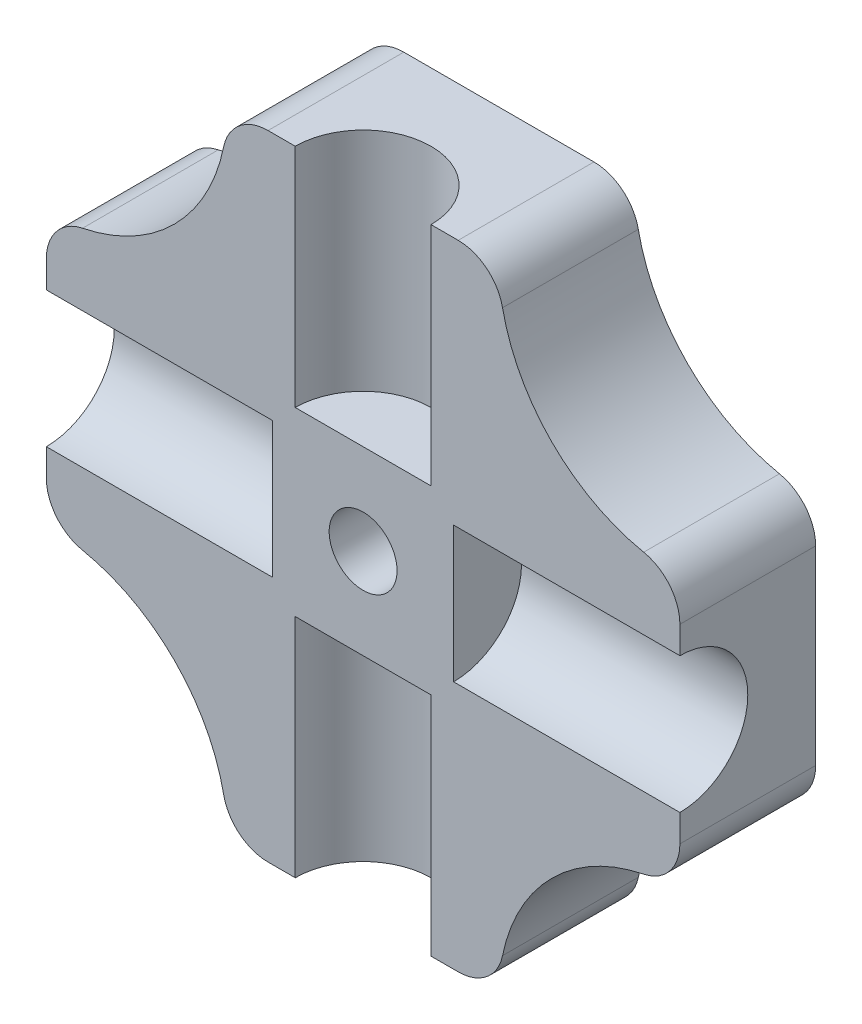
ISO-10303-21;
HEADER;
FILE_DESCRIPTION(('STEP AP214'),'2;1');
FILE_NAME('part.step','',(''),(''),'','','');
FILE_SCHEMA(('AUTOMOTIVE_DESIGN { 1 0 10303 214 1 1 1 1 }'));
ENDSEC;
DATA;
#1=APPLICATION_CONTEXT('core data for automotive mechanical design processes');
#2=APPLICATION_PROTOCOL_DEFINITION('international standard','automotive_design',2000,#1);
#3=PRODUCT_CONTEXT('',#1,'mechanical');
#4=PRODUCT('Part','Part','',(#3));
#5=PRODUCT_RELATED_PRODUCT_CATEGORY('part','',(#4));
#6=PRODUCT_DEFINITION_FORMATION('','',#4);
#7=PRODUCT_DEFINITION_CONTEXT('part definition',#1,'design');
#8=PRODUCT_DEFINITION('design','',#6,#7);
#9=PRODUCT_DEFINITION_SHAPE('','',#8);
#10=(LENGTH_UNIT() NAMED_UNIT(*) SI_UNIT(.MILLI.,.METRE.));
#11=(NAMED_UNIT(*) PLANE_ANGLE_UNIT() SI_UNIT($,.RADIAN.));
#12=(NAMED_UNIT(*) SI_UNIT($,.STERADIAN.) SOLID_ANGLE_UNIT());
#13=UNCERTAINTY_MEASURE_WITH_UNIT(LENGTH_MEASURE(1.E-05),#10,'distance_accuracy_value','');
#14=(GEOMETRIC_REPRESENTATION_CONTEXT(3) GLOBAL_UNCERTAINTY_ASSIGNED_CONTEXT((#13)) GLOBAL_UNIT_ASSIGNED_CONTEXT((#10,
#11,#12)) REPRESENTATION_CONTEXT('',''));
#15=CARTESIAN_POINT('',(0.,0.,0.));
#16=DIRECTION('',(0.,0.,1.));
#17=DIRECTION('',(1.,0.,0.));
#18=AXIS2_PLACEMENT_3D('',#15,#16,#17);
#19=CARTESIAN_POINT('',(-4.20204102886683,12.0000000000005,6.));
#20=DIRECTION('',(0.,0.,-1.));
#21=DIRECTION('',(-1.,0.,0.));
#22=AXIS2_PLACEMENT_3D('',#19,#20,#21);
#23=PLANE('',#22);
#24=DIRECTION('',(0.,1.,0.));
#25=VECTOR('',#24,1.);
#26=CARTESIAN_POINT('',(-4.00000000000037,12.0000000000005,6.));
#27=LINE('',#26,#25);
#28=CARTESIAN_POINT('',(-4.00000000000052,-2.99999999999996,6.));
#29=VERTEX_POINT('',#28);
#30=CARTESIAN_POINT('',(-4.00000000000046,3.00000000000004,6.));
#31=VERTEX_POINT('',#30);
#32=EDGE_CURVE('E11',#29,#31,#27,.T.);
#33=ORIENTED_EDGE('',*,*,#32,.F.);
#34=DIRECTION('',(-1.,0.,0.));
#35=VECTOR('',#34,1.);
#36=CARTESIAN_POINT('',(-4.00000000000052,-2.99999999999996,6.));
#37=LINE('',#36,#35);
#38=CARTESIAN_POINT('',(-14.0000000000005,-2.99999999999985,6.));
#39=VERTEX_POINT('',#38);
#40=EDGE_CURVE('E198',#29,#39,#37,.T.);
#41=ORIENTED_EDGE('',*,*,#40,.T.);
#42=DIRECTION('',(0.,-1.,0.));
#43=VECTOR('',#42,1.);
#44=CARTESIAN_POINT('',(-14.,4.20204102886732,6.));
#45=LINE('',#44,#43);
#46=CARTESIAN_POINT('',(-14.,-4.20204102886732,6.));
#47=VERTEX_POINT('',#46);
#48=EDGE_CURVE('E286',#39,#47,#45,.T.);
#49=ORIENTED_EDGE('',*,*,#48,.T.);
#50=CARTESIAN_POINT('',(-12.,-4.20204102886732,6.));
#51=DIRECTION('',(0.,0.,1.));
#52=DIRECTION('',(1.,0.,0.));
#53=AXIS2_PLACEMENT_3D('',#50,#51,#52);
#54=CIRCLE('',#53,2.);
#55=CARTESIAN_POINT('',(-12.4,-6.16163282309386,6.));
#56=VERTEX_POINT('',#55);
#57=EDGE_CURVE('E288',#47,#56,#54,.T.);
#58=ORIENTED_EDGE('',*,*,#57,.T.);
#59=CARTESIAN_POINT('',(-14.0000000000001,-14.,6.));
#60=DIRECTION('',(0.,0.,-1.));
#61=DIRECTION('',(1.,0.,0.));
#62=AXIS2_PLACEMENT_3D('',#59,#60,#61);
#63=CIRCLE('',#62,7.99999999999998);
#64=CARTESIAN_POINT('',(-6.16163282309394,-12.4,6.));
#65=VERTEX_POINT('',#64);
#66=EDGE_CURVE('E290',#56,#65,#63,.T.);
#67=ORIENTED_EDGE('',*,*,#66,.T.);
#68=CARTESIAN_POINT('',(-4.2020410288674,-12.,6.));
#69=DIRECTION('',(0.,0.,1.));
#70=DIRECTION('',(1.,0.,0.));
#71=AXIS2_PLACEMENT_3D('',#68,#69,#70);
#72=CIRCLE('',#71,2.);
#73=CARTESIAN_POINT('',(-4.2020410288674,-14.,6.));
#74=VERTEX_POINT('',#73);
#75=EDGE_CURVE('E292',#65,#74,#72,.T.);
#76=ORIENTED_EDGE('',*,*,#75,.T.);
#77=DIRECTION('',(1.,0.,0.));
#78=VECTOR('',#77,1.);
#79=CARTESIAN_POINT('',(-4.2020410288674,-14.,6.));
#80=LINE('',#79,#78);
#81=CARTESIAN_POINT('',(-3.0000000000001,-14.,6.));
#82=VERTEX_POINT('',#81);
#83=EDGE_CURVE('E295',#74,#82,#80,.T.);
#84=ORIENTED_EDGE('',*,*,#83,.T.);
#85=DIRECTION('',(0.,-1.,0.));
#86=VECTOR('',#85,1.);
#87=CARTESIAN_POINT('',(-3.00000000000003,-4.00000000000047,6.));
#88=LINE('',#87,#86);
#89=CARTESIAN_POINT('',(-3.00000000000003,-4.00000000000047,6.));
#90=VERTEX_POINT('',#89);
#91=EDGE_CURVE('E54',#82,#90,#88,.F.);
#92=ORIENTED_EDGE('',*,*,#91,.T.);
#93=DIRECTION('',(-1.,0.,0.));
#94=VECTOR('',#93,1.);
#95=CARTESIAN_POINT('',(-4.20204102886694,-4.00000000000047,6.));
#96=LINE('',#95,#94);
#97=CARTESIAN_POINT('',(2.99999999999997,-4.00000000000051,6.));
#98=VERTEX_POINT('',#97);
#99=EDGE_CURVE('E39',#98,#90,#96,.T.);
#100=ORIENTED_EDGE('',*,*,#99,.F.);
#101=DIRECTION('',(0.,-1.,0.));
#102=VECTOR('',#101,1.);
#103=CARTESIAN_POINT('',(2.99999999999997,-4.00000000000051,6.));
#104=LINE('',#103,#102);
#105=CARTESIAN_POINT('',(2.9999999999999,-14.0000000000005,6.));
#106=VERTEX_POINT('',#105);
#107=EDGE_CURVE('E215',#98,#106,#104,.T.);
#108=ORIENTED_EDGE('',*,*,#107,.T.);
#109=CARTESIAN_POINT('',(4.20204102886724,-14.,6.));
#110=VERTEX_POINT('',#109);
#111=EDGE_CURVE('E294',#106,#110,#80,.T.);
#112=ORIENTED_EDGE('',*,*,#111,.T.);
#113=CARTESIAN_POINT('',(4.20204102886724,-12.,6.));
#114=DIRECTION('',(0.,0.,1.));
#115=DIRECTION('',(-1.,0.,0.));
#116=AXIS2_PLACEMENT_3D('',#113,#114,#115);
#117=CIRCLE('',#116,2.);
#118=CARTESIAN_POINT('',(6.16163282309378,-12.4,6.));
#119=VERTEX_POINT('',#118);
#120=EDGE_CURVE('E298',#110,#119,#117,.T.);
#121=ORIENTED_EDGE('',*,*,#120,.T.);
#122=CARTESIAN_POINT('',(13.9999999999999,-14.,6.));
#123=DIRECTION('',(0.,0.,-1.));
#124=DIRECTION('',(1.,0.,0.));
#125=AXIS2_PLACEMENT_3D('',#122,#123,#124);
#126=CIRCLE('',#125,8.);
#127=CARTESIAN_POINT('',(12.4,-6.16163282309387,6.));
#128=VERTEX_POINT('',#127);
#129=EDGE_CURVE('E300',#119,#128,#126,.T.);
#130=ORIENTED_EDGE('',*,*,#129,.T.);
#131=CARTESIAN_POINT('',(12.,-4.20204102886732,6.));
#132=DIRECTION('',(0.,0.,1.));
#133=DIRECTION('',(1.,0.,0.));
#134=AXIS2_PLACEMENT_3D('',#131,#132,#133);
#135=CIRCLE('',#134,2.);
#136=CARTESIAN_POINT('',(14.,-4.20204102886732,6.));
#137=VERTEX_POINT('',#136);
#138=EDGE_CURVE('E302',#128,#137,#135,.T.);
#139=ORIENTED_EDGE('',*,*,#138,.T.);
#140=DIRECTION('',(0.,1.,0.));
#141=VECTOR('',#140,1.);
#142=CARTESIAN_POINT('',(14.,4.20204102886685,6.));
#143=LINE('',#142,#141);
#144=CARTESIAN_POINT('',(14.,-3.00000000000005,6.));
#145=VERTEX_POINT('',#144);
#146=EDGE_CURVE('E305',#137,#145,#143,.T.);
#147=ORIENTED_EDGE('',*,*,#146,.T.);
#148=DIRECTION('',(1.,0.,0.));
#149=VECTOR('',#148,1.);
#150=CARTESIAN_POINT('',(4.00000000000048,-3.00000000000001,6.));
#151=LINE('',#150,#149);
#152=CARTESIAN_POINT('',(4.00000000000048,-3.00000000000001,6.));
#153=VERTEX_POINT('',#152);
#154=EDGE_CURVE('E223',#145,#153,#151,.F.);
#155=ORIENTED_EDGE('',*,*,#154,.T.);
#156=DIRECTION('',(0.,-1.,0.));
#157=VECTOR('',#156,1.);
#158=CARTESIAN_POINT('',(4.00000000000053,12.0000000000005,6.));
#159=LINE('',#158,#157);
#160=CARTESIAN_POINT('',(4.0000000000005,2.99999999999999,6.));
#161=VERTEX_POINT('',#160);
#162=EDGE_CURVE('E368',#161,#153,#159,.T.);
#163=ORIENTED_EDGE('',*,*,#162,.F.);
#164=DIRECTION('',(1.,0.,0.));
#165=VECTOR('',#164,1.);
#166=CARTESIAN_POINT('',(4.0000000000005,2.99999999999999,6.));
#167=LINE('',#166,#165);
#168=CARTESIAN_POINT('',(14.0000000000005,2.99999999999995,6.));
#169=VERTEX_POINT('',#168);
#170=EDGE_CURVE('E226',#161,#169,#167,.T.);
#171=ORIENTED_EDGE('',*,*,#170,.T.);
#172=CARTESIAN_POINT('',(14.,4.20204102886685,6.));
#173=VERTEX_POINT('',#172);
#174=EDGE_CURVE('E304',#169,#173,#143,.T.);
#175=ORIENTED_EDGE('',*,*,#174,.T.);
#176=CARTESIAN_POINT('',(12.,4.20204102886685,6.));
#177=DIRECTION('',(0.,0.,1.));
#178=DIRECTION('',(-1.,0.,0.));
#179=AXIS2_PLACEMENT_3D('',#176,#177,#178);
#180=CIRCLE('',#179,2.00000000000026);
#181=CARTESIAN_POINT('',(12.4000000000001,6.16163282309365,6.));
#182=VERTEX_POINT('',#181);
#183=EDGE_CURVE('E308',#173,#182,#180,.T.);
#184=ORIENTED_EDGE('',*,*,#183,.T.);
#185=CARTESIAN_POINT('',(14.0000000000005,13.9999999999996,6.));
#186=DIRECTION('',(0.,0.,-1.));
#187=DIRECTION('',(1.,0.,0.));
#188=AXIS2_PLACEMENT_3D('',#185,#186,#187);
#189=CIRCLE('',#188,7.99999999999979);
#190=CARTESIAN_POINT('',(6.16163282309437,12.4000000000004,6.));
#191=VERTEX_POINT('',#190);
#192=EDGE_CURVE('E310',#182,#191,#189,.T.);
#193=ORIENTED_EDGE('',*,*,#192,.T.);
#194=CARTESIAN_POINT('',(4.20204102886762,12.0000000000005,6.));
#195=DIRECTION('',(0.,0.,1.));
#196=DIRECTION('',(-1.,0.,0.));
#197=AXIS2_PLACEMENT_3D('',#194,#195,#196);
#198=CIRCLE('',#197,2.);
#199=CARTESIAN_POINT('',(4.20204102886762,14.0000000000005,6.));
#200=VERTEX_POINT('',#199);
#201=EDGE_CURVE('E312',#191,#200,#198,.T.);
#202=ORIENTED_EDGE('',*,*,#201,.T.);
#203=DIRECTION('',(-1.,0.,0.));
#204=VECTOR('',#203,1.);
#205=CARTESIAN_POINT('',(-4.20204102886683,14.0000000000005,6.));
#206=LINE('',#205,#204);
#207=CARTESIAN_POINT('',(3.,14.0000000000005,6.));
#208=VERTEX_POINT('',#207);
#209=EDGE_CURVE('E315',#200,#208,#206,.T.);
#210=ORIENTED_EDGE('',*,*,#209,.T.);
#211=DIRECTION('',(0.,1.,0.));
#212=VECTOR('',#211,1.);
#213=CARTESIAN_POINT('',(3.,4.00000000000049,6.));
#214=LINE('',#213,#212);
#215=CARTESIAN_POINT('',(3.,4.00000000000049,6.));
#216=VERTEX_POINT('',#215);
#217=EDGE_CURVE('E234',#208,#216,#214,.F.);
#218=ORIENTED_EDGE('',*,*,#217,.T.);
#219=DIRECTION('',(1.,0.,0.));
#220=VECTOR('',#219,1.);
#221=CARTESIAN_POINT('',(-4.20204102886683,4.00000000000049,6.));
#222=LINE('',#221,#220);
#223=CARTESIAN_POINT('',(-3.,4.00000000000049,6.));
#224=VERTEX_POINT('',#223);
#225=EDGE_CURVE('E366',#224,#216,#222,.T.);
#226=ORIENTED_EDGE('',*,*,#225,.F.);
#227=DIRECTION('',(0.,1.,0.));
#228=VECTOR('',#227,1.);
#229=CARTESIAN_POINT('',(-3.,4.00000000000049,6.));
#230=LINE('',#229,#228);
#231=CARTESIAN_POINT('',(-3.,14.0000000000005,6.));
#232=VERTEX_POINT('',#231);
#233=EDGE_CURVE('E237',#224,#232,#230,.T.);
#234=ORIENTED_EDGE('',*,*,#233,.T.);
#235=CARTESIAN_POINT('',(-4.20204102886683,14.0000000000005,6.));
#236=VERTEX_POINT('',#235);
#237=EDGE_CURVE('E314',#232,#236,#206,.T.);
#238=ORIENTED_EDGE('',*,*,#237,.T.);
#239=CARTESIAN_POINT('',(-4.20204102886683,12.0000000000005,6.));
#240=DIRECTION('',(0.,0.,1.));
#241=DIRECTION('',(-1.,0.,0.));
#242=AXIS2_PLACEMENT_3D('',#239,#240,#241);
#243=CIRCLE('',#242,2.);
#244=CARTESIAN_POINT('',(-6.16163282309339,12.4000000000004,6.));
#245=VERTEX_POINT('',#244);
#246=EDGE_CURVE('E279',#236,#245,#243,.T.);
#247=ORIENTED_EDGE('',*,*,#246,.T.);
#248=CARTESIAN_POINT('',(-13.9999999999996,14.0000000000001,6.));
#249=DIRECTION('',(0.,0.,-1.));
#250=DIRECTION('',(1.,0.,0.));
#251=AXIS2_PLACEMENT_3D('',#248,#249,#250);
#252=CIRCLE('',#251,7.99999999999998);
#253=CARTESIAN_POINT('',(-12.3999999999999,6.16163282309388,6.));
#254=VERTEX_POINT('',#253);
#255=EDGE_CURVE('E282',#245,#254,#252,.T.);
#256=ORIENTED_EDGE('',*,*,#255,.T.);
#257=CARTESIAN_POINT('',(-12.,4.20204102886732,6.));
#258=DIRECTION('',(0.,0.,1.));
#259=DIRECTION('',(1.,0.,0.));
#260=AXIS2_PLACEMENT_3D('',#257,#258,#259);
#261=CIRCLE('',#260,2.);
#262=CARTESIAN_POINT('',(-14.,4.20204102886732,6.));
#263=VERTEX_POINT('',#262);
#264=EDGE_CURVE('E284',#254,#263,#261,.T.);
#265=ORIENTED_EDGE('',*,*,#264,.T.);
#266=CARTESIAN_POINT('',(-14.,3.00000000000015,6.));
#267=VERTEX_POINT('',#266);
#268=EDGE_CURVE('E204',#263,#267,#45,.T.);
#269=ORIENTED_EDGE('',*,*,#268,.T.);
#270=DIRECTION('',(-1.,0.,0.));
#271=VECTOR('',#270,1.);
#272=CARTESIAN_POINT('',(-4.00000000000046,3.00000000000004,6.));
#273=LINE('',#272,#271);
#274=EDGE_CURVE('E46',#267,#31,#273,.F.);
#275=ORIENTED_EDGE('',*,*,#274,.T.);
#276=EDGE_LOOP('',(#33,#41,#49,#58,#67,#76,#84,#92,#100,#108,#112,#121,#130,#139,#147,#155,#163,
#171,#175,#184,#193,#202,#210,#218,#226,#234,#238,#247,#256,#265,#269,#275));
#277=FACE_BOUND('',#276,.T.);
#278=CARTESIAN_POINT('',(0.,0.,6.));
#279=DIRECTION('',(0.,0.,1.));
#280=DIRECTION('',(1.,0.,0.));
#281=AXIS2_PLACEMENT_3D('',#278,#279,#280);
#282=CIRCLE('',#281,1.5);
#283=CARTESIAN_POINT('',(1.5,0.,6.));
#284=VERTEX_POINT('',#283);
#285=EDGE_CURVE('E243',#284,#284,#282,.T.);
#286=ORIENTED_EDGE('',*,*,#285,.F.);
#287=EDGE_LOOP('',(#286));
#288=FACE_BOUND('',#287,.T.);
#289=ADVANCED_FACE('F31',(#277,#288),#23,.F.);
#290=CARTESIAN_POINT('',(-4.20204102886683,12.0000000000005,0.));
#291=DIRECTION('',(0.,0.,-1.));
#292=DIRECTION('',(-1.,0.,0.));
#293=AXIS2_PLACEMENT_3D('',#290,#291,#292);
#294=PLANE('',#293);
#295=CARTESIAN_POINT('',(-4.20204102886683,12.0000000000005,0.));
#296=DIRECTION('',(0.,0.,1.));
#297=DIRECTION('',(-1.,0.,0.));
#298=AXIS2_PLACEMENT_3D('',#295,#296,#297);
#299=CIRCLE('',#298,2.);
#300=CARTESIAN_POINT('',(-4.20204102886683,14.0000000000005,0.));
#301=VERTEX_POINT('',#300);
#302=CARTESIAN_POINT('',(-6.16163282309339,12.4000000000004,0.));
#303=VERTEX_POINT('',#302);
#304=EDGE_CURVE('E246',#301,#303,#299,.T.);
#305=ORIENTED_EDGE('',*,*,#304,.F.);
#306=DIRECTION('',(-1.,0.,0.));
#307=VECTOR('',#306,1.);
#308=CARTESIAN_POINT('',(-4.20204102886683,14.0000000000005,0.));
#309=LINE('',#308,#307);
#310=CARTESIAN_POINT('',(4.20204102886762,14.0000000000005,0.));
#311=VERTEX_POINT('',#310);
#312=EDGE_CURVE('E277',#311,#301,#309,.T.);
#313=ORIENTED_EDGE('',*,*,#312,.F.);
#314=CARTESIAN_POINT('',(4.20204102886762,12.0000000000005,0.));
#315=DIRECTION('',(0.,0.,1.));
#316=DIRECTION('',(-1.,0.,0.));
#317=AXIS2_PLACEMENT_3D('',#314,#315,#316);
#318=CIRCLE('',#317,2.);
#319=CARTESIAN_POINT('',(6.16163282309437,12.4000000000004,0.));
#320=VERTEX_POINT('',#319);
#321=EDGE_CURVE('E275',#320,#311,#318,.T.);
#322=ORIENTED_EDGE('',*,*,#321,.F.);
#323=CARTESIAN_POINT('',(14.0000000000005,13.9999999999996,0.));
#324=DIRECTION('',(0.,0.,-1.));
#325=DIRECTION('',(1.,0.,0.));
#326=AXIS2_PLACEMENT_3D('',#323,#324,#325);
#327=CIRCLE('',#326,7.99999999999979);
#328=CARTESIAN_POINT('',(12.4000000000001,6.16163282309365,0.));
#329=VERTEX_POINT('',#328);
#330=EDGE_CURVE('E273',#329,#320,#327,.T.);
#331=ORIENTED_EDGE('',*,*,#330,.F.);
#332=CARTESIAN_POINT('',(12.,4.20204102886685,0.));
#333=DIRECTION('',(0.,0.,1.));
#334=DIRECTION('',(-1.,0.,0.));
#335=AXIS2_PLACEMENT_3D('',#332,#333,#334);
#336=CIRCLE('',#335,2.00000000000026);
#337=CARTESIAN_POINT('',(14.,4.20204102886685,0.));
#338=VERTEX_POINT('',#337);
#339=EDGE_CURVE('E271',#338,#329,#336,.T.);
#340=ORIENTED_EDGE('',*,*,#339,.F.);
#341=DIRECTION('',(0.,1.,0.));
#342=VECTOR('',#341,1.);
#343=CARTESIAN_POINT('',(14.,4.20204102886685,0.));
#344=LINE('',#343,#342);
#345=CARTESIAN_POINT('',(14.,-4.20204102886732,0.));
#346=VERTEX_POINT('',#345);
#347=EDGE_CURVE('E269',#346,#338,#344,.T.);
#348=ORIENTED_EDGE('',*,*,#347,.F.);
#349=CARTESIAN_POINT('',(12.,-4.20204102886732,0.));
#350=DIRECTION('',(0.,0.,1.));
#351=DIRECTION('',(1.,0.,0.));
#352=AXIS2_PLACEMENT_3D('',#349,#350,#351);
#353=CIRCLE('',#352,2.);
#354=CARTESIAN_POINT('',(12.4,-6.16163282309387,0.));
#355=VERTEX_POINT('',#354);
#356=EDGE_CURVE('E267',#355,#346,#353,.T.);
#357=ORIENTED_EDGE('',*,*,#356,.F.);
#358=CARTESIAN_POINT('',(13.9999999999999,-14.,0.));
#359=DIRECTION('',(0.,0.,-1.));
#360=DIRECTION('',(1.,0.,0.));
#361=AXIS2_PLACEMENT_3D('',#358,#359,#360);
#362=CIRCLE('',#361,8.);
#363=CARTESIAN_POINT('',(6.16163282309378,-12.4,0.));
#364=VERTEX_POINT('',#363);
#365=EDGE_CURVE('E265',#364,#355,#362,.T.);
#366=ORIENTED_EDGE('',*,*,#365,.F.);
#367=CARTESIAN_POINT('',(4.20204102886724,-12.,0.));
#368=DIRECTION('',(0.,0.,1.));
#369=DIRECTION('',(-1.,0.,0.));
#370=AXIS2_PLACEMENT_3D('',#367,#368,#369);
#371=CIRCLE('',#370,2.);
#372=CARTESIAN_POINT('',(4.20204102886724,-14.,0.));
#373=VERTEX_POINT('',#372);
#374=EDGE_CURVE('E263',#373,#364,#371,.T.);
#375=ORIENTED_EDGE('',*,*,#374,.F.);
#376=DIRECTION('',(1.,0.,0.));
#377=VECTOR('',#376,1.);
#378=CARTESIAN_POINT('',(-4.2020410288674,-14.,0.));
#379=LINE('',#378,#377);
#380=CARTESIAN_POINT('',(-4.2020410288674,-14.,0.));
#381=VERTEX_POINT('',#380);
#382=EDGE_CURVE('E261',#381,#373,#379,.T.);
#383=ORIENTED_EDGE('',*,*,#382,.F.);
#384=CARTESIAN_POINT('',(-4.2020410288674,-12.,0.));
#385=DIRECTION('',(0.,0.,1.));
#386=DIRECTION('',(1.,0.,0.));
#387=AXIS2_PLACEMENT_3D('',#384,#385,#386);
#388=CIRCLE('',#387,2.);
#389=CARTESIAN_POINT('',(-6.16163282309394,-12.4,0.));
#390=VERTEX_POINT('',#389);
#391=EDGE_CURVE('E259',#390,#381,#388,.T.);
#392=ORIENTED_EDGE('',*,*,#391,.F.);
#393=CARTESIAN_POINT('',(-14.0000000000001,-14.,0.));
#394=DIRECTION('',(0.,0.,-1.));
#395=DIRECTION('',(1.,0.,0.));
#396=AXIS2_PLACEMENT_3D('',#393,#394,#395);
#397=CIRCLE('',#396,7.99999999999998);
#398=CARTESIAN_POINT('',(-12.4,-6.16163282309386,0.));
#399=VERTEX_POINT('',#398);
#400=EDGE_CURVE('E257',#399,#390,#397,.T.);
#401=ORIENTED_EDGE('',*,*,#400,.F.);
#402=CARTESIAN_POINT('',(-12.,-4.20204102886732,0.));
#403=DIRECTION('',(0.,0.,1.));
#404=DIRECTION('',(1.,0.,0.));
#405=AXIS2_PLACEMENT_3D('',#402,#403,#404);
#406=CIRCLE('',#405,2.);
#407=CARTESIAN_POINT('',(-14.,-4.20204102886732,0.));
#408=VERTEX_POINT('',#407);
#409=EDGE_CURVE('E255',#408,#399,#406,.T.);
#410=ORIENTED_EDGE('',*,*,#409,.F.);
#411=DIRECTION('',(0.,-1.,0.));
#412=VECTOR('',#411,1.);
#413=CARTESIAN_POINT('',(-14.,4.20204102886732,0.));
#414=LINE('',#413,#412);
#415=CARTESIAN_POINT('',(-14.,4.20204102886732,0.));
#416=VERTEX_POINT('',#415);
#417=EDGE_CURVE('E253',#416,#408,#414,.T.);
#418=ORIENTED_EDGE('',*,*,#417,.F.);
#419=CARTESIAN_POINT('',(-12.,4.20204102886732,0.));
#420=DIRECTION('',(0.,0.,1.));
#421=DIRECTION('',(1.,0.,0.));
#422=AXIS2_PLACEMENT_3D('',#419,#420,#421);
#423=CIRCLE('',#422,2.);
#424=CARTESIAN_POINT('',(-12.3999999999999,6.16163282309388,0.));
#425=VERTEX_POINT('',#424);
#426=EDGE_CURVE('E251',#425,#416,#423,.T.);
#427=ORIENTED_EDGE('',*,*,#426,.F.);
#428=CARTESIAN_POINT('',(-13.9999999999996,14.0000000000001,0.));
#429=DIRECTION('',(0.,0.,-1.));
#430=DIRECTION('',(1.,0.,0.));
#431=AXIS2_PLACEMENT_3D('',#428,#429,#430);
#432=CIRCLE('',#431,7.99999999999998);
#433=EDGE_CURVE('E249',#303,#425,#432,.T.);
#434=ORIENTED_EDGE('',*,*,#433,.F.);
#435=EDGE_LOOP('',(#305,#313,#322,#331,#340,#348,#357,#366,#375,#383,#392,#401,#410,#418,#427,#434));
#436=FACE_BOUND('',#435,.T.);
#437=CARTESIAN_POINT('',(0.,0.,0.));
#438=DIRECTION('',(0.,0.,1.));
#439=DIRECTION('',(1.,0.,0.));
#440=AXIS2_PLACEMENT_3D('',#437,#438,#439);
#441=CIRCLE('',#440,1.5);
#442=CARTESIAN_POINT('',(1.5,0.,0.));
#443=VERTEX_POINT('',#442);
#444=EDGE_CURVE('E240',#443,#443,#441,.T.);
#445=ORIENTED_EDGE('',*,*,#444,.T.);
#446=EDGE_LOOP('',(#445));
#447=FACE_BOUND('',#446,.T.);
#448=ADVANCED_FACE('F423',(#436,#447),#294,.T.);
#449=CARTESIAN_POINT('',(-4.20204102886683,12.0000000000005,6.));
#450=DIRECTION('',(0.,0.,-1.));
#451=DIRECTION('',(-1.,0.,0.));
#452=AXIS2_PLACEMENT_3D('',#449,#450,#451);
#453=CYLINDRICAL_SURFACE('',#452,2.);
#454=ORIENTED_EDGE('',*,*,#304,.T.);
#455=DIRECTION('',(0.,0.,-1.));
#456=VECTOR('',#455,1.);
#457=CARTESIAN_POINT('',(-6.16163282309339,12.4000000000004,6.));
#458=LINE('',#457,#456);
#459=EDGE_CURVE('E363',#245,#303,#458,.T.);
#460=ORIENTED_EDGE('',*,*,#459,.F.);
#461=ORIENTED_EDGE('',*,*,#246,.F.);
#462=DIRECTION('',(0.,0.,-1.));
#463=VECTOR('',#462,1.);
#464=CARTESIAN_POINT('',(-4.20204102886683,14.0000000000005,6.));
#465=LINE('',#464,#463);
#466=EDGE_CURVE('E318',#236,#301,#465,.T.);
#467=ORIENTED_EDGE('',*,*,#466,.T.);
#468=EDGE_LOOP('',(#454,#460,#461,#467));
#469=FACE_BOUND('',#468,.T.);
#470=ADVANCED_FACE('F33',(#469),#453,.T.);
#471=CARTESIAN_POINT('',(-13.9999999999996,14.0000000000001,6.));
#472=DIRECTION('',(0.,0.,-1.));
#473=DIRECTION('',(-1.,0.,0.));
#474=AXIS2_PLACEMENT_3D('',#471,#472,#473);
#475=CYLINDRICAL_SURFACE('',#474,7.99999999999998);
#476=ORIENTED_EDGE('',*,*,#433,.T.);
#477=DIRECTION('',(0.,0.,-1.));
#478=VECTOR('',#477,1.);
#479=CARTESIAN_POINT('',(-12.3999999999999,6.16163282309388,6.));
#480=LINE('',#479,#478);
#481=EDGE_CURVE('E360',#254,#425,#480,.T.);
#482=ORIENTED_EDGE('',*,*,#481,.F.);
#483=ORIENTED_EDGE('',*,*,#255,.F.);
#484=ORIENTED_EDGE('',*,*,#459,.T.);
#485=EDGE_LOOP('',(#476,#482,#483,#484));
#486=FACE_BOUND('',#485,.T.);
#487=ADVANCED_FACE('F476',(#486),#475,.F.);
#488=CARTESIAN_POINT('',(-12.,4.20204102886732,6.));
#489=DIRECTION('',(0.,0.,-1.));
#490=DIRECTION('',(-1.,0.,0.));
#491=AXIS2_PLACEMENT_3D('',#488,#489,#490);
#492=CYLINDRICAL_SURFACE('',#491,2.);
#493=ORIENTED_EDGE('',*,*,#426,.T.);
#494=DIRECTION('',(0.,0.,-1.));
#495=VECTOR('',#494,1.);
#496=CARTESIAN_POINT('',(-14.,4.20204102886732,6.));
#497=LINE('',#496,#495);
#498=EDGE_CURVE('E357',#263,#416,#497,.T.);
#499=ORIENTED_EDGE('',*,*,#498,.F.);
#500=ORIENTED_EDGE('',*,*,#264,.F.);
#501=ORIENTED_EDGE('',*,*,#481,.T.);
#502=EDGE_LOOP('',(#493,#499,#500,#501));
#503=FACE_BOUND('',#502,.T.);
#504=ADVANCED_FACE('F473',(#503),#492,.T.);
#505=CARTESIAN_POINT('',(-14.,4.20204102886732,6.));
#506=DIRECTION('',(1.,0.,0.));
#507=DIRECTION('',(0.,1.,0.));
#508=AXIS2_PLACEMENT_3D('',#505,#506,#507);
#509=PLANE('',#508);
#510=ORIENTED_EDGE('',*,*,#48,.F.);
#511=CARTESIAN_POINT('',(-14.0000000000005,1.46642301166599E-13,6.));
#512=DIRECTION('',(-1.,0.,0.));
#513=DIRECTION('',(0.,0.,1.));
#514=AXIS2_PLACEMENT_3D('',#511,#512,#513);
#515=CIRCLE('',#514,3.);
#516=EDGE_CURVE('E199',#267,#39,#515,.T.);
#517=ORIENTED_EDGE('',*,*,#516,.F.);
#518=ORIENTED_EDGE('',*,*,#268,.F.);
#519=ORIENTED_EDGE('',*,*,#498,.T.);
#520=ORIENTED_EDGE('',*,*,#417,.T.);
#521=DIRECTION('',(0.,0.,-1.));
#522=VECTOR('',#521,1.);
#523=CARTESIAN_POINT('',(-14.,-4.20204102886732,6.));
#524=LINE('',#523,#522);
#525=EDGE_CURVE('E354',#47,#408,#524,.T.);
#526=ORIENTED_EDGE('',*,*,#525,.F.);
#527=EDGE_LOOP('',(#510,#517,#518,#519,#520,#526));
#528=FACE_BOUND('',#527,.T.);
#529=ADVANCED_FACE('F470',(#528),#509,.F.);
#530=CARTESIAN_POINT('',(-12.,-4.20204102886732,6.));
#531=DIRECTION('',(0.,0.,-1.));
#532=DIRECTION('',(-1.,0.,0.));
#533=AXIS2_PLACEMENT_3D('',#530,#531,#532);
#534=CYLINDRICAL_SURFACE('',#533,2.);
#535=ORIENTED_EDGE('',*,*,#409,.T.);
#536=DIRECTION('',(0.,0.,-1.));
#537=VECTOR('',#536,1.);
#538=CARTESIAN_POINT('',(-12.4,-6.16163282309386,6.));
#539=LINE('',#538,#537);
#540=EDGE_CURVE('E351',#56,#399,#539,.T.);
#541=ORIENTED_EDGE('',*,*,#540,.F.);
#542=ORIENTED_EDGE('',*,*,#57,.F.);
#543=ORIENTED_EDGE('',*,*,#525,.T.);
#544=EDGE_LOOP('',(#535,#541,#542,#543));
#545=FACE_BOUND('',#544,.T.);
#546=ADVANCED_FACE('F466',(#545),#534,.T.);
#547=CARTESIAN_POINT('',(-14.0000000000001,-14.,6.));
#548=DIRECTION('',(0.,0.,-1.));
#549=DIRECTION('',(-1.,0.,0.));
#550=AXIS2_PLACEMENT_3D('',#547,#548,#549);
#551=CYLINDRICAL_SURFACE('',#550,7.99999999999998);
#552=ORIENTED_EDGE('',*,*,#400,.T.);
#553=DIRECTION('',(0.,0.,-1.));
#554=VECTOR('',#553,1.);
#555=CARTESIAN_POINT('',(-6.16163282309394,-12.4,6.));
#556=LINE('',#555,#554);
#557=EDGE_CURVE('E348',#65,#390,#556,.T.);
#558=ORIENTED_EDGE('',*,*,#557,.F.);
#559=ORIENTED_EDGE('',*,*,#66,.F.);
#560=ORIENTED_EDGE('',*,*,#540,.T.);
#561=EDGE_LOOP('',(#552,#558,#559,#560));
#562=FACE_BOUND('',#561,.T.);
#563=ADVANCED_FACE('F462',(#562),#551,.F.);
#564=CARTESIAN_POINT('',(-4.2020410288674,-12.,6.));
#565=DIRECTION('',(0.,0.,-1.));
#566=DIRECTION('',(-1.,0.,0.));
#567=AXIS2_PLACEMENT_3D('',#564,#565,#566);
#568=CYLINDRICAL_SURFACE('',#567,2.);
#569=ORIENTED_EDGE('',*,*,#391,.T.);
#570=DIRECTION('',(0.,0.,-1.));
#571=VECTOR('',#570,1.);
#572=CARTESIAN_POINT('',(-4.2020410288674,-14.,6.));
#573=LINE('',#572,#571);
#574=EDGE_CURVE('E345',#74,#381,#573,.T.);
#575=ORIENTED_EDGE('',*,*,#574,.F.);
#576=ORIENTED_EDGE('',*,*,#75,.F.);
#577=ORIENTED_EDGE('',*,*,#557,.T.);
#578=EDGE_LOOP('',(#569,#575,#576,#577));
#579=FACE_BOUND('',#578,.T.);
#580=ADVANCED_FACE('F459',(#579),#568,.T.);
#581=CARTESIAN_POINT('',(-4.2020410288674,-14.,6.));
#582=DIRECTION('',(0.,1.,0.));
#583=DIRECTION('',(0.,0.,1.));
#584=AXIS2_PLACEMENT_3D('',#581,#582,#583);
#585=PLANE('',#584);
#586=ORIENTED_EDGE('',*,*,#111,.F.);
#587=CARTESIAN_POINT('',(0.,-14.0000000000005,6.));
#588=DIRECTION('',(0.,-1.,0.));
#589=DIRECTION('',(0.,0.,1.));
#590=AXIS2_PLACEMENT_3D('',#587,#588,#589);
#591=CIRCLE('',#590,3.);
#592=EDGE_CURVE('E206',#82,#106,#591,.T.);
#593=ORIENTED_EDGE('',*,*,#592,.F.);
#594=ORIENTED_EDGE('',*,*,#83,.F.);
#595=ORIENTED_EDGE('',*,*,#574,.T.);
#596=ORIENTED_EDGE('',*,*,#382,.T.);
#597=DIRECTION('',(0.,0.,-1.));
#598=VECTOR('',#597,1.);
#599=CARTESIAN_POINT('',(4.20204102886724,-14.,6.));
#600=LINE('',#599,#598);
#601=EDGE_CURVE('E342',#110,#373,#600,.T.);
#602=ORIENTED_EDGE('',*,*,#601,.F.);
#603=EDGE_LOOP('',(#586,#593,#594,#595,#596,#602));
#604=FACE_BOUND('',#603,.T.);
#605=ADVANCED_FACE('F378',(#604),#585,.F.);
#606=CARTESIAN_POINT('',(4.20204102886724,-12.,6.));
#607=DIRECTION('',(0.,0.,-1.));
#608=DIRECTION('',(-1.,0.,0.));
#609=AXIS2_PLACEMENT_3D('',#606,#607,#608);
#610=CYLINDRICAL_SURFACE('',#609,2.);
#611=ORIENTED_EDGE('',*,*,#374,.T.);
#612=DIRECTION('',(0.,0.,-1.));
#613=VECTOR('',#612,1.);
#614=CARTESIAN_POINT('',(6.16163282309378,-12.4,6.));
#615=LINE('',#614,#613);
#616=EDGE_CURVE('E339',#119,#364,#615,.T.);
#617=ORIENTED_EDGE('',*,*,#616,.F.);
#618=ORIENTED_EDGE('',*,*,#120,.F.);
#619=ORIENTED_EDGE('',*,*,#601,.T.);
#620=EDGE_LOOP('',(#611,#617,#618,#619));
#621=FACE_BOUND('',#620,.T.);
#622=ADVANCED_FACE('F385',(#621),#610,.T.);
#623=CARTESIAN_POINT('',(13.9999999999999,-14.,6.));
#624=DIRECTION('',(0.,0.,-1.));
#625=DIRECTION('',(-1.,0.,0.));
#626=AXIS2_PLACEMENT_3D('',#623,#624,#625);
#627=CYLINDRICAL_SURFACE('',#626,8.);
#628=ORIENTED_EDGE('',*,*,#365,.T.);
#629=DIRECTION('',(0.,0.,-1.));
#630=VECTOR('',#629,1.);
#631=CARTESIAN_POINT('',(12.4,-6.16163282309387,6.));
#632=LINE('',#631,#630);
#633=EDGE_CURVE('E336',#128,#355,#632,.T.);
#634=ORIENTED_EDGE('',*,*,#633,.F.);
#635=ORIENTED_EDGE('',*,*,#129,.F.);
#636=ORIENTED_EDGE('',*,*,#616,.T.);
#637=EDGE_LOOP('',(#628,#634,#635,#636));
#638=FACE_BOUND('',#637,.T.);
#639=ADVANCED_FACE('F390',(#638),#627,.F.);
#640=CARTESIAN_POINT('',(12.,-4.20204102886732,6.));
#641=DIRECTION('',(0.,0.,-1.));
#642=DIRECTION('',(-1.,0.,0.));
#643=AXIS2_PLACEMENT_3D('',#640,#641,#642);
#644=CYLINDRICAL_SURFACE('',#643,2.);
#645=ORIENTED_EDGE('',*,*,#356,.T.);
#646=DIRECTION('',(0.,0.,-1.));
#647=VECTOR('',#646,1.);
#648=CARTESIAN_POINT('',(14.,-4.20204102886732,6.));
#649=LINE('',#648,#647);
#650=EDGE_CURVE('E333',#137,#346,#649,.T.);
#651=ORIENTED_EDGE('',*,*,#650,.F.);
#652=ORIENTED_EDGE('',*,*,#138,.F.);
#653=ORIENTED_EDGE('',*,*,#633,.T.);
#654=EDGE_LOOP('',(#645,#651,#652,#653));
#655=FACE_BOUND('',#654,.T.);
#656=ADVANCED_FACE('F395',(#655),#644,.T.);
#657=CARTESIAN_POINT('',(14.,4.20204102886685,6.));
#658=DIRECTION('',(-1.,0.,0.));
#659=DIRECTION('',(0.,0.,1.));
#660=AXIS2_PLACEMENT_3D('',#657,#658,#659);
#661=PLANE('',#660);
#662=ORIENTED_EDGE('',*,*,#174,.F.);
#663=CARTESIAN_POINT('',(14.0000000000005,0.,6.));
#664=DIRECTION('',(1.,0.,0.));
#665=DIRECTION('',(0.,0.,1.));
#666=AXIS2_PLACEMENT_3D('',#663,#664,#665);
#667=CIRCLE('',#666,3.);
#668=EDGE_CURVE('E218',#145,#169,#667,.T.);
#669=ORIENTED_EDGE('',*,*,#668,.F.);
#670=ORIENTED_EDGE('',*,*,#146,.F.);
#671=ORIENTED_EDGE('',*,*,#650,.T.);
#672=ORIENTED_EDGE('',*,*,#347,.T.);
#673=DIRECTION('',(0.,0.,-1.));
#674=VECTOR('',#673,1.);
#675=CARTESIAN_POINT('',(14.,4.20204102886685,6.));
#676=LINE('',#675,#674);
#677=EDGE_CURVE('E330',#173,#338,#676,.T.);
#678=ORIENTED_EDGE('',*,*,#677,.F.);
#679=EDGE_LOOP('',(#662,#669,#670,#671,#672,#678));
#680=FACE_BOUND('',#679,.T.);
#681=ADVANCED_FACE('F401',(#680),#661,.F.);
#682=CARTESIAN_POINT('',(12.,4.20204102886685,6.));
#683=DIRECTION('',(0.,0.,-1.));
#684=DIRECTION('',(-1.,0.,0.));
#685=AXIS2_PLACEMENT_3D('',#682,#683,#684);
#686=CYLINDRICAL_SURFACE('',#685,2.00000000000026);
#687=ORIENTED_EDGE('',*,*,#339,.T.);
#688=DIRECTION('',(0.,0.,-1.));
#689=VECTOR('',#688,1.);
#690=CARTESIAN_POINT('',(12.4000000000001,6.16163282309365,6.));
#691=LINE('',#690,#689);
#692=EDGE_CURVE('E327',#182,#329,#691,.T.);
#693=ORIENTED_EDGE('',*,*,#692,.F.);
#694=ORIENTED_EDGE('',*,*,#183,.F.);
#695=ORIENTED_EDGE('',*,*,#677,.T.);
#696=EDGE_LOOP('',(#687,#693,#694,#695));
#697=FACE_BOUND('',#696,.T.);
#698=ADVANCED_FACE('F445',(#697),#686,.T.);
#699=CARTESIAN_POINT('',(14.0000000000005,13.9999999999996,6.));
#700=DIRECTION('',(0.,0.,-1.));
#701=DIRECTION('',(-1.,0.,0.));
#702=AXIS2_PLACEMENT_3D('',#699,#700,#701);
#703=CYLINDRICAL_SURFACE('',#702,7.99999999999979);
#704=ORIENTED_EDGE('',*,*,#330,.T.);
#705=DIRECTION('',(0.,0.,-1.));
#706=VECTOR('',#705,1.);
#707=CARTESIAN_POINT('',(6.16163282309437,12.4000000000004,6.));
#708=LINE('',#707,#706);
#709=EDGE_CURVE('E324',#191,#320,#708,.T.);
#710=ORIENTED_EDGE('',*,*,#709,.F.);
#711=ORIENTED_EDGE('',*,*,#192,.F.);
#712=ORIENTED_EDGE('',*,*,#692,.T.);
#713=EDGE_LOOP('',(#704,#710,#711,#712));
#714=FACE_BOUND('',#713,.T.);
#715=ADVANCED_FACE('F441',(#714),#703,.F.);
#716=CARTESIAN_POINT('',(4.20204102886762,12.0000000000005,6.));
#717=DIRECTION('',(0.,0.,-1.));
#718=DIRECTION('',(-1.,0.,0.));
#719=AXIS2_PLACEMENT_3D('',#716,#717,#718);
#720=CYLINDRICAL_SURFACE('',#719,2.);
#721=ORIENTED_EDGE('',*,*,#321,.T.);
#722=DIRECTION('',(0.,0.,-1.));
#723=VECTOR('',#722,1.);
#724=CARTESIAN_POINT('',(4.20204102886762,14.0000000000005,6.));
#725=LINE('',#724,#723);
#726=EDGE_CURVE('E321',#200,#311,#725,.T.);
#727=ORIENTED_EDGE('',*,*,#726,.F.);
#728=ORIENTED_EDGE('',*,*,#201,.F.);
#729=ORIENTED_EDGE('',*,*,#709,.T.);
#730=EDGE_LOOP('',(#721,#727,#728,#729));
#731=FACE_BOUND('',#730,.T.);
#732=ADVANCED_FACE('F437',(#731),#720,.T.);
#733=CARTESIAN_POINT('',(-4.20204102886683,14.0000000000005,6.));
#734=DIRECTION('',(0.,-1.,0.));
#735=DIRECTION('',(0.,0.,-1.));
#736=AXIS2_PLACEMENT_3D('',#733,#734,#735);
#737=PLANE('',#736);
#738=ORIENTED_EDGE('',*,*,#237,.F.);
#739=CARTESIAN_POINT('',(0.,14.0000000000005,6.));
#740=DIRECTION('',(0.,1.,0.));
#741=DIRECTION('',(0.,0.,1.));
#742=AXIS2_PLACEMENT_3D('',#739,#740,#741);
#743=CIRCLE('',#742,3.);
#744=EDGE_CURVE('E229',#208,#232,#743,.T.);
#745=ORIENTED_EDGE('',*,*,#744,.F.);
#746=ORIENTED_EDGE('',*,*,#209,.F.);
#747=ORIENTED_EDGE('',*,*,#726,.T.);
#748=ORIENTED_EDGE('',*,*,#312,.T.);
#749=ORIENTED_EDGE('',*,*,#466,.F.);
#750=EDGE_LOOP('',(#738,#745,#746,#747,#748,#749));
#751=FACE_BOUND('',#750,.T.);
#752=ADVANCED_FACE('F433',(#751),#737,.F.);
#753=CARTESIAN_POINT('',(0.,0.,6.));
#754=DIRECTION('',(0.,0.,-1.));
#755=DIRECTION('',(-1.,0.,0.));
#756=AXIS2_PLACEMENT_3D('',#753,#754,#755);
#757=CYLINDRICAL_SURFACE('',#756,1.5);
#758=ORIENTED_EDGE('',*,*,#285,.T.);
#759=EDGE_LOOP('',(#758));
#760=FACE_BOUND('',#759,.T.);
#761=ORIENTED_EDGE('',*,*,#444,.F.);
#762=EDGE_LOOP('',(#761));
#763=FACE_BOUND('',#762,.T.);
#764=ADVANCED_FACE('F436',(#760,#763),#757,.F.);
#765=CARTESIAN_POINT('',(0.,4.00000000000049,6.));
#766=DIRECTION('',(0.,1.,0.));
#767=DIRECTION('',(0.,0.,1.));
#768=AXIS2_PLACEMENT_3D('',#765,#766,#767);
#769=PLANE('',#768);
#770=ORIENTED_EDGE('',*,*,#225,.T.);
#771=CARTESIAN_POINT('',(0.,4.00000000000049,6.));
#772=DIRECTION('',(0.,1.,0.));
#773=DIRECTION('',(0.,0.,1.));
#774=AXIS2_PLACEMENT_3D('',#771,#772,#773);
#775=CIRCLE('',#774,3.);
#776=EDGE_CURVE('E231',#216,#224,#775,.T.);
#777=ORIENTED_EDGE('',*,*,#776,.T.);
#778=EDGE_LOOP('',(#770,#777));
#779=FACE_BOUND('',#778,.T.);
#780=ADVANCED_FACE('F418',(#779),#769,.T.);
#781=CARTESIAN_POINT('',(0.,4.00000000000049,6.));
#782=DIRECTION('',(0.,1.,0.));
#783=DIRECTION('',(0.,0.,1.));
#784=AXIS2_PLACEMENT_3D('',#781,#782,#783);
#785=CYLINDRICAL_SURFACE('',#784,3.);
#786=ORIENTED_EDGE('',*,*,#776,.F.);
#787=ORIENTED_EDGE('',*,*,#217,.F.);
#788=ORIENTED_EDGE('',*,*,#744,.T.);
#789=ORIENTED_EDGE('',*,*,#233,.F.);
#790=EDGE_LOOP('',(#786,#787,#788,#789));
#791=FACE_BOUND('',#790,.T.);
#792=ADVANCED_FACE('F410',(#791),#785,.F.);
#793=CARTESIAN_POINT('',(4.00000000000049,0.,6.));
#794=DIRECTION('',(1.,0.,0.));
#795=DIRECTION('',(0.,0.,1.));
#796=AXIS2_PLACEMENT_3D('',#793,#794,#795);
#797=PLANE('',#796);
#798=ORIENTED_EDGE('',*,*,#162,.T.);
#799=CARTESIAN_POINT('',(4.00000000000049,0.,6.));
#800=DIRECTION('',(1.,0.,0.));
#801=DIRECTION('',(0.,0.,1.));
#802=AXIS2_PLACEMENT_3D('',#799,#800,#801);
#803=CIRCLE('',#802,3.);
#804=EDGE_CURVE('E220',#153,#161,#803,.T.);
#805=ORIENTED_EDGE('',*,*,#804,.T.);
#806=EDGE_LOOP('',(#798,#805));
#807=FACE_BOUND('',#806,.T.);
#808=ADVANCED_FACE('F408',(#807),#797,.T.);
#809=CARTESIAN_POINT('',(4.00000000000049,0.,6.));
#810=DIRECTION('',(1.,0.,0.));
#811=DIRECTION('',(0.,1.,0.));
#812=AXIS2_PLACEMENT_3D('',#809,#810,#811);
#813=CYLINDRICAL_SURFACE('',#812,3.);
#814=ORIENTED_EDGE('',*,*,#804,.F.);
#815=ORIENTED_EDGE('',*,*,#154,.F.);
#816=ORIENTED_EDGE('',*,*,#668,.T.);
#817=ORIENTED_EDGE('',*,*,#170,.F.);
#818=EDGE_LOOP('',(#814,#815,#816,#817));
#819=FACE_BOUND('',#818,.T.);
#820=ADVANCED_FACE('F405',(#819),#813,.F.);
#821=CARTESIAN_POINT('',(0.,-4.00000000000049,6.));
#822=DIRECTION('',(0.,-1.,0.));
#823=DIRECTION('',(0.,0.,1.));
#824=AXIS2_PLACEMENT_3D('',#821,#822,#823);
#825=PLANE('',#824);
#826=ORIENTED_EDGE('',*,*,#99,.T.);
#827=CARTESIAN_POINT('',(0.,-4.00000000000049,6.));
#828=DIRECTION('',(0.,-1.,0.));
#829=DIRECTION('',(0.,0.,1.));
#830=AXIS2_PLACEMENT_3D('',#827,#828,#829);
#831=CIRCLE('',#830,3.);
#832=EDGE_CURVE('E211',#90,#98,#831,.T.);
#833=ORIENTED_EDGE('',*,*,#832,.T.);
#834=EDGE_LOOP('',(#826,#833));
#835=FACE_BOUND('',#834,.T.);
#836=ADVANCED_FACE('F371',(#835),#825,.T.);
#837=CARTESIAN_POINT('',(0.,-4.00000000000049,6.));
#838=DIRECTION('',(0.,-1.,0.));
#839=DIRECTION('',(1.,0.,0.));
#840=AXIS2_PLACEMENT_3D('',#837,#838,#839);
#841=CYLINDRICAL_SURFACE('',#840,3.);
#842=ORIENTED_EDGE('',*,*,#832,.F.);
#843=ORIENTED_EDGE('',*,*,#91,.F.);
#844=ORIENTED_EDGE('',*,*,#592,.T.);
#845=ORIENTED_EDGE('',*,*,#107,.F.);
#846=EDGE_LOOP('',(#842,#843,#844,#845));
#847=FACE_BOUND('',#846,.T.);
#848=ADVANCED_FACE('F372',(#847),#841,.F.);
#849=CARTESIAN_POINT('',(-4.00000000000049,0.,6.));
#850=DIRECTION('',(-1.,0.,0.));
#851=DIRECTION('',(0.,0.,1.));
#852=AXIS2_PLACEMENT_3D('',#849,#850,#851);
#853=PLANE('',#852);
#854=ORIENTED_EDGE('',*,*,#32,.T.);
#855=CARTESIAN_POINT('',(-4.00000000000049,0.,6.));
#856=DIRECTION('',(-1.,0.,0.));
#857=DIRECTION('',(0.,0.,1.));
#858=AXIS2_PLACEMENT_3D('',#855,#856,#857);
#859=CIRCLE('',#858,3.);
#860=EDGE_CURVE('E194',#31,#29,#859,.T.);
#861=ORIENTED_EDGE('',*,*,#860,.T.);
#862=EDGE_LOOP('',(#854,#861));
#863=FACE_BOUND('',#862,.T.);
#864=ADVANCED_FACE('F193',(#863),#853,.T.);
#865=CARTESIAN_POINT('',(-4.00000000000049,0.,6.));
#866=DIRECTION('',(-1.,0.,0.));
#867=DIRECTION('',(0.,-1.,0.));
#868=AXIS2_PLACEMENT_3D('',#865,#866,#867);
#869=CYLINDRICAL_SURFACE('',#868,3.);
#870=ORIENTED_EDGE('',*,*,#860,.F.);
#871=ORIENTED_EDGE('',*,*,#274,.F.);
#872=ORIENTED_EDGE('',*,*,#516,.T.);
#873=ORIENTED_EDGE('',*,*,#40,.F.);
#874=EDGE_LOOP('',(#870,#871,#872,#873));
#875=FACE_BOUND('',#874,.T.);
#876=ADVANCED_FACE('F197',(#875),#869,.F.);
#877=CLOSED_SHELL('',(#289,#448,#470,#487,#504,#529,#546,#563,#580,#605,#622,#639,#656,#681,
#698,#715,#732,#752,#764,#780,#792,#808,#820,#836,#848,#864,#876));
#878=MANIFOLD_SOLID_BREP('B2',#877);
#879=ADVANCED_BREP_SHAPE_REPRESENTATION('',(#18,#878),#14);
#880=SHAPE_DEFINITION_REPRESENTATION(#9,#879);
ENDSEC;
END-ISO-10303-21;
